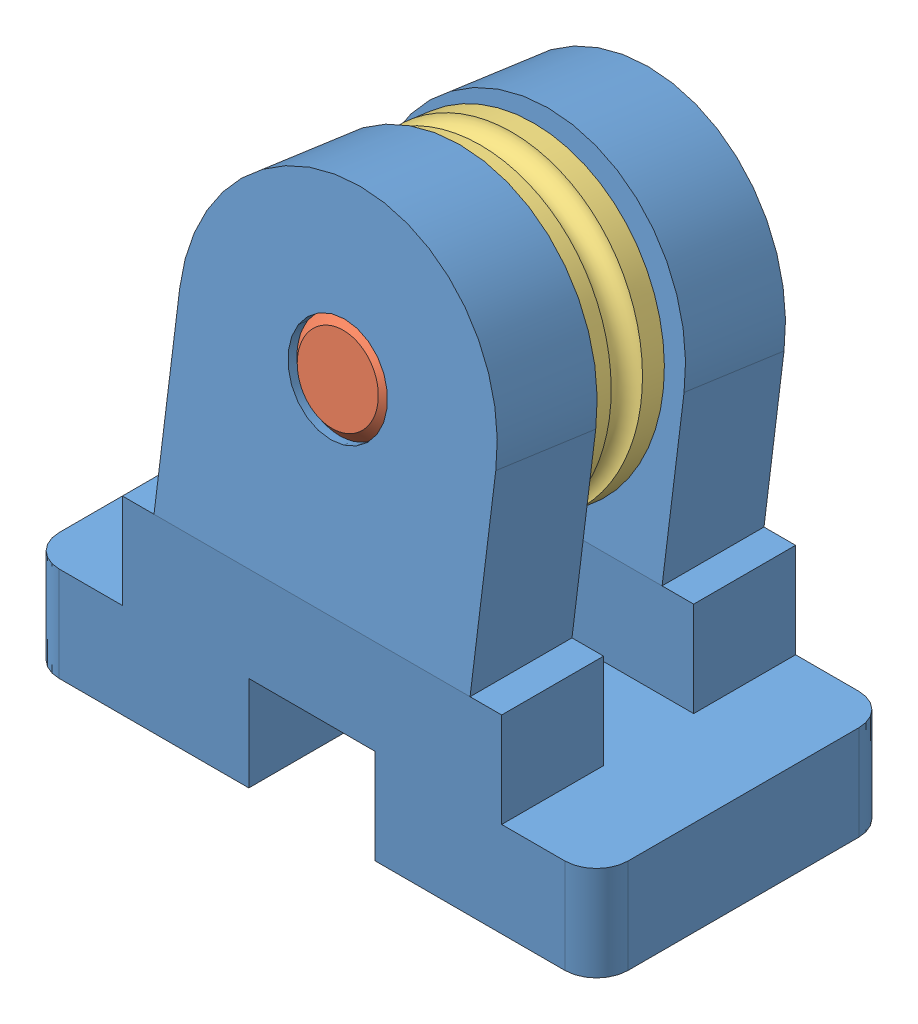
SolidWorks assembly block_b1.SLDASM, configuration Default (file format 5000). Lengths in mm.
Overall size (18 16.74 10.63).
3 component instances, 3 part files, 4 mates.
Components (placement in the parent):
- b2-1: b2.SLDPRT [Default] at (-5.8313 -7.2693 2.9977) size (18 16.74 10.63)
- 97395A435-1: 97395A435.SLDPRT [97395A435] at (-5.8313 3.8564 2.118) x (0 -0.139173 -0.990268) z (0.990268 -0.137819 0.019369) size (9.53 3.17 3.17)
- pulley-1: pulley.SLDPRT [Default] at (-5.8313 3.9078 2.4833) x (1 0 0) z (0 -0.990268 0.139173) size (9.5 2.4 9.5)
Mates (geometry in assembly coordinates):
- Concentric1: concentric anti-aligned: cylinder of b2-1 through (-5.8313 2.9381 -4.4162) axis (0 0.139173 0.990268) radius 1.5625; cylinder of pulley-1 through (-5.8313 3.9078 2.4833) axis (0 -0.139173 -0.990268) radius 1.5
- Concentric2: concentric anti-aligned: cylinder of b2-1 through (-5.8313 2.9381 -4.4162) axis (0 0.139173 0.990268) radius 1.5625; cylinder of 97395A435-1 through (-5.8313 4.5192 6.8341) axis (0 -0.139173 -0.990268) radius 1.5875
- Coincident1: coincident aligned: plane of b2-1 through (-10.8313 -6.5123 8.3845) normal (0 0.139173 0.990268); plane of 97395A435-1 through (-5.8313 4.5192 6.8341) normal (0 0.139173 0.990268)
- Coincident2: coincident anti-aligned: plane of b2-1 through (-10.8313 -6.9567 5.222) normal (0 -0.139173 -0.990268); plane of pulley-1 through (-4.3313 4.0748 3.6716) normal (0 0.139173 0.990268)
